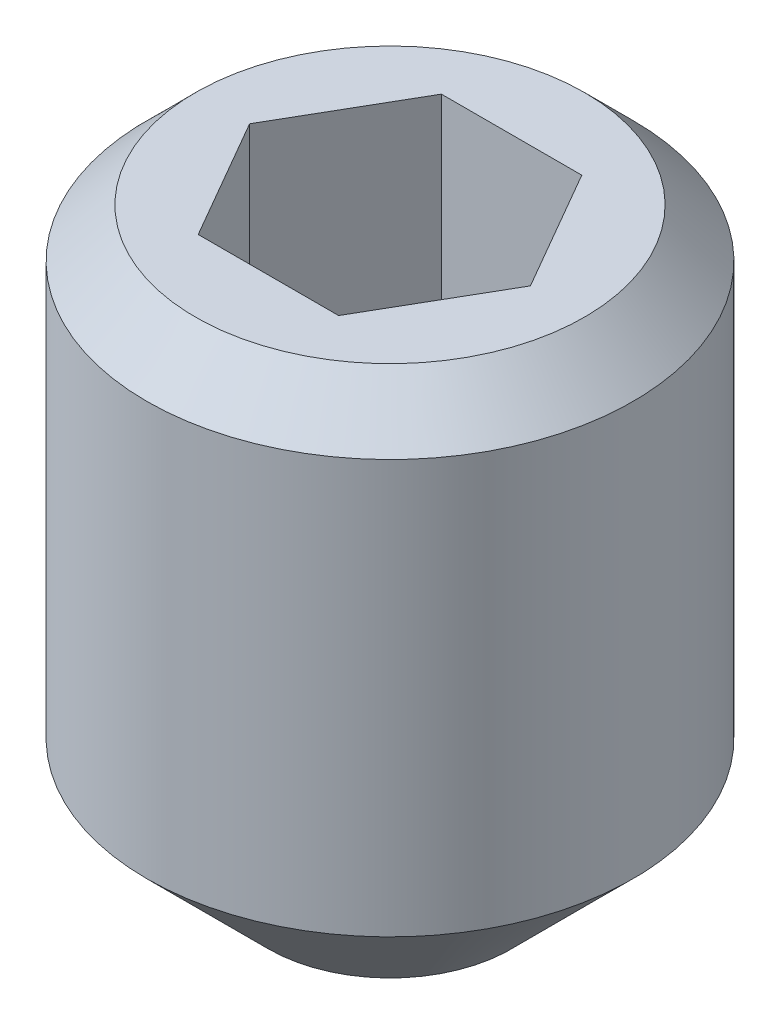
from build123d import *

# Parameters (mm, degrees)
T_TE_DEPTH = 2.5


with BuildPart() as part:
    # Esquisse1 → Tige (revolve)
    with BuildSketch(Plane.XY, mode=Mode.PRIVATE) as tige_sk:
        Polygon((1.25, 0), (2, 0), (2.5, -0.5), (2.5, -4.75), (1.25, -6), (0, -5.278312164), (0, -3.221687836), (1.25, -2.5), align=None)
    revolve(tige_sk.sketch.rotate(Axis((0, -6, 0), (0, 1, 0)), 90), axis=Axis((0, -6, 0), (0, 1, 0)))

    # Esquisse2 → T_te (cut)
    with BuildSketch(Plane(origin=(0, 0, 0), x_dir=(-1, 0, 0), z_dir=(0, 1, 0))):
        Polygon((1.443375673, 0), (0.721687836, 1.25), (-0.721687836, 1.25), (-1.443375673, 0), (-0.721687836, -1.25), (0.721687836, -1.25), align=None)
    extrude(amount=-T_TE_DEPTH, mode=Mode.SUBTRACT)


solid = part.part
